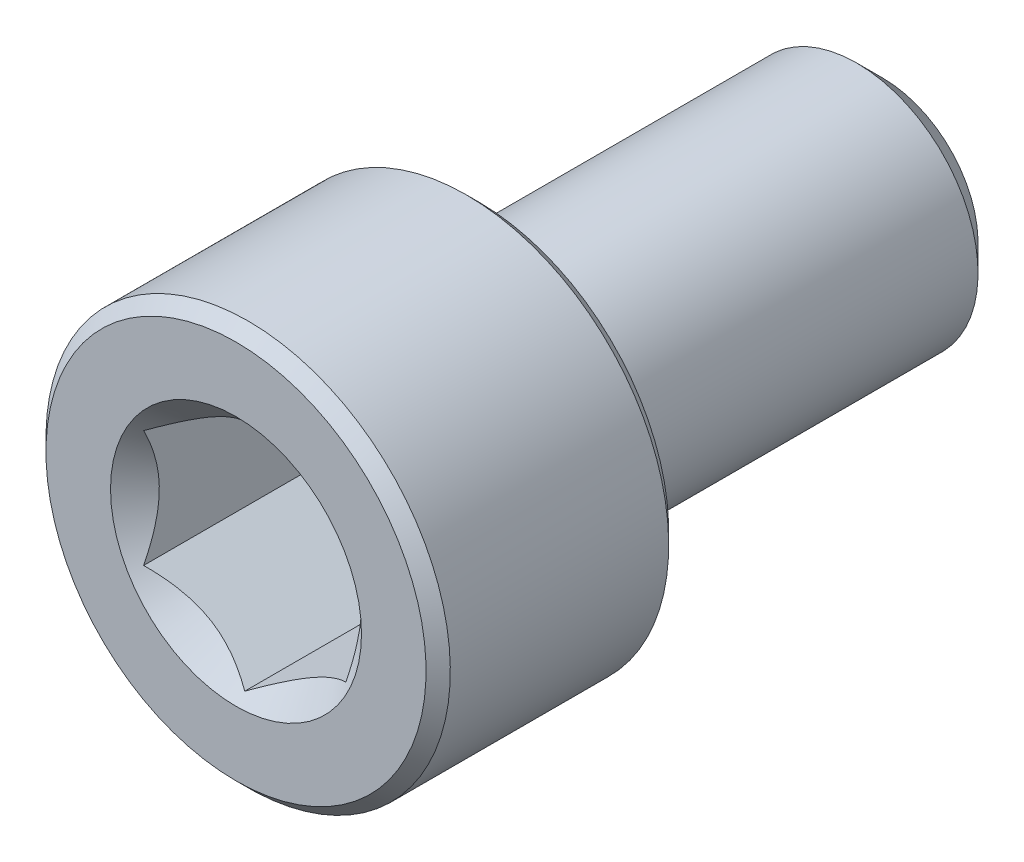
ISO-10303-21;
HEADER;
FILE_DESCRIPTION(('STEP AP214'),'2;1');
FILE_NAME('part.step','',(''),(''),'','','');
FILE_SCHEMA(('AUTOMOTIVE_DESIGN { 1 0 10303 214 1 1 1 1 }'));
ENDSEC;
DATA;
#1=APPLICATION_CONTEXT('core data for automotive mechanical design processes');
#2=APPLICATION_PROTOCOL_DEFINITION('international standard','automotive_design',2000,#1);
#3=PRODUCT_CONTEXT('',#1,'mechanical');
#4=PRODUCT('Part','Part','',(#3));
#5=PRODUCT_RELATED_PRODUCT_CATEGORY('part','',(#4));
#6=PRODUCT_DEFINITION_FORMATION('','',#4);
#7=PRODUCT_DEFINITION_CONTEXT('part definition',#1,'design');
#8=PRODUCT_DEFINITION('design','',#6,#7);
#9=PRODUCT_DEFINITION_SHAPE('','',#8);
#10=(LENGTH_UNIT() NAMED_UNIT(*) SI_UNIT(.MILLI.,.METRE.));
#11=(NAMED_UNIT(*) PLANE_ANGLE_UNIT() SI_UNIT($,.RADIAN.));
#12=(NAMED_UNIT(*) SI_UNIT($,.STERADIAN.) SOLID_ANGLE_UNIT());
#13=UNCERTAINTY_MEASURE_WITH_UNIT(LENGTH_MEASURE(1.E-05),#10,'distance_accuracy_value','');
#14=(GEOMETRIC_REPRESENTATION_CONTEXT(3) GLOBAL_UNCERTAINTY_ASSIGNED_CONTEXT((#13)) GLOBAL_UNIT_ASSIGNED_CONTEXT((#10,
#11,#12)) REPRESENTATION_CONTEXT('',''));
#15=CARTESIAN_POINT('',(0.,0.,0.));
#16=DIRECTION('',(0.,0.,1.));
#17=DIRECTION('',(1.,0.,0.));
#18=AXIS2_PLACEMENT_3D('',#15,#16,#17);
#19=CARTESIAN_POINT('',(0.,2.35048094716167,-8.));
#20=DIRECTION('',(0.,0.,-1.));
#21=DIRECTION('',(0.,1.,0.));
#22=AXIS2_PLACEMENT_3D('',#19,#20,#21);
#23=PLANE('',#22);
#24=CARTESIAN_POINT('',(0.,0.,-8.));
#25=DIRECTION('',(0.,0.,-1.));
#26=DIRECTION('',(0.,1.,0.));
#27=AXIS2_PLACEMENT_3D('',#24,#25,#26);
#28=CIRCLE('',#27,2.35048094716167);
#29=CARTESIAN_POINT('',(0.,2.35048094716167,-8.));
#30=VERTEX_POINT('',#29);
#31=EDGE_CURVE('E48',#30,#30,#28,.T.);
#32=ORIENTED_EDGE('',*,*,#31,.T.);
#33=EDGE_LOOP('',(#32));
#34=FACE_BOUND('',#33,.T.);
#35=ADVANCED_FACE('F35',(#34),#23,.T.);
#36=CARTESIAN_POINT('',(0.,0.,-8.));
#37=DIRECTION('',(0.,0.,1.));
#38=DIRECTION('',(0.,-1.,0.));
#39=AXIS2_PLACEMENT_3D('',#36,#37,#38);
#40=CONICAL_SURFACE('',#39,2.35048094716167,0.785398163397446);
#41=CARTESIAN_POINT('',(0.,0.,-7.35048094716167));
#42=DIRECTION('',(0.,0.,-1.));
#43=DIRECTION('',(0.,1.,0.));
#44=AXIS2_PLACEMENT_3D('',#41,#42,#43);
#45=CIRCLE('',#44,3.);
#46=CARTESIAN_POINT('',(0.,3.,-7.35048094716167));
#47=VERTEX_POINT('',#46);
#48=EDGE_CURVE('E151',#47,#47,#45,.T.);
#49=ORIENTED_EDGE('',*,*,#48,.T.);
#50=EDGE_LOOP('',(#49));
#51=FACE_BOUND('',#50,.T.);
#52=ORIENTED_EDGE('',*,*,#31,.F.);
#53=EDGE_LOOP('',(#52));
#54=FACE_BOUND('',#53,.T.);
#55=ADVANCED_FACE('F157',(#51,#54),#40,.T.);
#56=CARTESIAN_POINT('',(0.,0.,-8.));
#57=DIRECTION('',(0.,0.,-1.));
#58=DIRECTION('',(0.,1.,0.));
#59=AXIS2_PLACEMENT_3D('',#56,#57,#58);
#60=CYLINDRICAL_SURFACE('',#59,3.);
#61=CARTESIAN_POINT('',(0.,0.,1.7));
#62=DIRECTION('',(0.,0.,-1.));
#63=DIRECTION('',(0.,1.,0.));
#64=AXIS2_PLACEMENT_3D('',#61,#62,#63);
#65=CIRCLE('',#64,3.);
#66=CARTESIAN_POINT('',(0.,3.,1.7));
#67=VERTEX_POINT('',#66);
#68=EDGE_CURVE('E148',#67,#67,#65,.T.);
#69=ORIENTED_EDGE('',*,*,#68,.T.);
#70=EDGE_LOOP('',(#69));
#71=FACE_BOUND('',#70,.T.);
#72=ORIENTED_EDGE('',*,*,#48,.F.);
#73=EDGE_LOOP('',(#72));
#74=FACE_BOUND('',#73,.T.);
#75=ADVANCED_FACE('F159',(#71,#74),#60,.T.);
#76=CARTESIAN_POINT('',(0.,0.,1.7));
#77=DIRECTION('',(0.,0.,-1.));
#78=DIRECTION('',(0.,1.,0.));
#79=AXIS2_PLACEMENT_3D('',#76,#77,#78);
#80=TOROIDAL_SURFACE('',#79,3.3,0.299999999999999);
#81=CARTESIAN_POINT('',(0.,0.,2.));
#82=DIRECTION('',(0.,0.,-1.));
#83=DIRECTION('',(0.,1.,0.));
#84=AXIS2_PLACEMENT_3D('',#81,#82,#83);
#85=CIRCLE('',#84,3.3);
#86=CARTESIAN_POINT('',(0.,3.3,2.));
#87=VERTEX_POINT('',#86);
#88=EDGE_CURVE('E145',#87,#87,#85,.T.);
#89=ORIENTED_EDGE('',*,*,#88,.T.);
#90=EDGE_LOOP('',(#89));
#91=FACE_BOUND('',#90,.T.);
#92=ORIENTED_EDGE('',*,*,#68,.F.);
#93=EDGE_LOOP('',(#92));
#94=FACE_BOUND('',#93,.T.);
#95=ADVANCED_FACE('F165',(#91,#94),#80,.F.);
#96=CARTESIAN_POINT('',(0.,4.7,2.));
#97=DIRECTION('',(0.,0.,-1.));
#98=DIRECTION('',(0.,1.,0.));
#99=AXIS2_PLACEMENT_3D('',#96,#97,#98);
#100=PLANE('',#99);
#101=CARTESIAN_POINT('',(0.,0.,2.));
#102=DIRECTION('',(0.,0.,-1.));
#103=DIRECTION('',(0.,1.,0.));
#104=AXIS2_PLACEMENT_3D('',#101,#102,#103);
#105=CIRCLE('',#104,4.7);
#106=CARTESIAN_POINT('',(0.,4.7,2.));
#107=VERTEX_POINT('',#106);
#108=EDGE_CURVE('E142',#107,#107,#105,.T.);
#109=ORIENTED_EDGE('',*,*,#108,.T.);
#110=EDGE_LOOP('',(#109));
#111=FACE_BOUND('',#110,.T.);
#112=ORIENTED_EDGE('',*,*,#88,.F.);
#113=EDGE_LOOP('',(#112));
#114=FACE_BOUND('',#113,.T.);
#115=ADVANCED_FACE('F171',(#111,#114),#100,.T.);
#116=CARTESIAN_POINT('',(0.,0.,2.));
#117=DIRECTION('',(0.,0.,1.));
#118=DIRECTION('',(0.,-1.,0.));
#119=AXIS2_PLACEMENT_3D('',#116,#117,#118);
#120=CONICAL_SURFACE('',#119,4.7,0.785398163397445);
#121=CARTESIAN_POINT('',(0.,0.,2.3));
#122=DIRECTION('',(0.,0.,-1.));
#123=DIRECTION('',(0.,1.,0.));
#124=AXIS2_PLACEMENT_3D('',#121,#122,#123);
#125=CIRCLE('',#124,5.);
#126=CARTESIAN_POINT('',(0.,5.,2.3));
#127=VERTEX_POINT('',#126);
#128=EDGE_CURVE('E139',#127,#127,#125,.T.);
#129=ORIENTED_EDGE('',*,*,#128,.T.);
#130=EDGE_LOOP('',(#129));
#131=FACE_BOUND('',#130,.T.);
#132=ORIENTED_EDGE('',*,*,#108,.F.);
#133=EDGE_LOOP('',(#132));
#134=FACE_BOUND('',#133,.T.);
#135=ADVANCED_FACE('F175',(#131,#134),#120,.T.);
#136=CARTESIAN_POINT('',(0.,0.,-8.));
#137=DIRECTION('',(0.,0.,-1.));
#138=DIRECTION('',(0.,1.,0.));
#139=AXIS2_PLACEMENT_3D('',#136,#137,#138);
#140=CYLINDRICAL_SURFACE('',#139,5.);
#141=CARTESIAN_POINT('',(0.,0.,7.7));
#142=DIRECTION('',(0.,0.,-1.));
#143=DIRECTION('',(0.,1.,0.));
#144=AXIS2_PLACEMENT_3D('',#141,#142,#143);
#145=CIRCLE('',#144,5.);
#146=CARTESIAN_POINT('',(0.,5.,7.7));
#147=VERTEX_POINT('',#146);
#148=EDGE_CURVE('E136',#147,#147,#145,.T.);
#149=ORIENTED_EDGE('',*,*,#148,.T.);
#150=EDGE_LOOP('',(#149));
#151=FACE_BOUND('',#150,.T.);
#152=ORIENTED_EDGE('',*,*,#128,.F.);
#153=EDGE_LOOP('',(#152));
#154=FACE_BOUND('',#153,.T.);
#155=ADVANCED_FACE('F179',(#151,#154),#140,.T.);
#156=CARTESIAN_POINT('',(0.,0.,7.7));
#157=DIRECTION('',(0.,0.,-1.));
#158=DIRECTION('',(0.,1.,0.));
#159=AXIS2_PLACEMENT_3D('',#156,#157,#158);
#160=CONICAL_SURFACE('',#159,5.,0.785398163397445);
#161=CARTESIAN_POINT('',(0.,0.,8.));
#162=DIRECTION('',(0.,0.,-1.));
#163=DIRECTION('',(0.,1.,0.));
#164=AXIS2_PLACEMENT_3D('',#161,#162,#163);
#165=CIRCLE('',#164,4.7);
#166=CARTESIAN_POINT('',(0.,4.7,8.));
#167=VERTEX_POINT('',#166);
#168=EDGE_CURVE('E133',#167,#167,#165,.T.);
#169=ORIENTED_EDGE('',*,*,#168,.T.);
#170=EDGE_LOOP('',(#169));
#171=FACE_BOUND('',#170,.T.);
#172=ORIENTED_EDGE('',*,*,#148,.F.);
#173=EDGE_LOOP('',(#172));
#174=FACE_BOUND('',#173,.T.);
#175=ADVANCED_FACE('F183',(#171,#174),#160,.T.);
#176=CARTESIAN_POINT('',(0.,0.,8.));
#177=DIRECTION('',(0.,0.,1.));
#178=DIRECTION('',(0.,-1.,0.));
#179=AXIS2_PLACEMENT_3D('',#176,#177,#178);
#180=PLANE('',#179);
#181=CARTESIAN_POINT('',(0.,0.,8.));
#182=DIRECTION('',(0.,0.,1.));
#183=DIRECTION('',(1.,0.,0.));
#184=AXIS2_PLACEMENT_3D('',#181,#182,#183);
#185=CIRCLE('',#184,3.10325769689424);
#186=CARTESIAN_POINT('',(3.10325769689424,0.,8.));
#187=VERTEX_POINT('',#186);
#188=EDGE_CURVE('E107',#187,#187,#185,.T.);
#189=ORIENTED_EDGE('',*,*,#188,.F.);
#190=EDGE_LOOP('',(#189));
#191=FACE_BOUND('',#190,.T.);
#192=ORIENTED_EDGE('',*,*,#168,.F.);
#193=EDGE_LOOP('',(#192));
#194=FACE_BOUND('',#193,.T.);
#195=ADVANCED_FACE('F187',(#191,#194),#180,.T.);
#196=CARTESIAN_POINT('',(0.,0.,8.));
#197=DIRECTION('',(0.,0.,1.));
#198=DIRECTION('',(1.,0.,0.));
#199=AXIS2_PLACEMENT_3D('',#196,#197,#198);
#200=CONICAL_SURFACE('',#199,3.10325769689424,0.78539816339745);
#201=ORIENTED_EDGE('',*,*,#188,.T.);
#202=EDGE_LOOP('',(#201));
#203=FACE_BOUND('',#202,.T.);
#204=CARTESIAN_POINT('',(-0.000199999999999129,-2.88686681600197,7.78360912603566));
#205=CARTESIAN_POINT('',(0.0857382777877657,-2.83725032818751,7.73403435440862));
#206=CARTESIAN_POINT('',(0.173113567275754,-2.7868041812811,7.6873711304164));
#207=CARTESIAN_POINT('',(0.35128145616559,-2.6839389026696,7.60193178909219));
#208=CARTESIAN_POINT('',(0.442091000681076,-2.6315099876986,7.56320321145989));
#209=CARTESIAN_POINT('',(0.625204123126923,-2.52578957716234,7.49686035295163));
#210=CARTESIAN_POINT('',(0.717461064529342,-2.47252500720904,7.46907931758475));
#211=CARTESIAN_POINT('',(0.904006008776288,-2.3648232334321,7.42627682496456));
#212=CARTESIAN_POINT('',(0.998288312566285,-2.31038931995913,7.41122341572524));
#213=CARTESIAN_POINT('',(1.16077825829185,-2.21657570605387,7.39764137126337));
#214=CARTESIAN_POINT('',(1.22877596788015,-2.17731721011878,7.39563074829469));
#215=CARTESIAN_POINT('',(1.36466024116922,-2.0988643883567,7.39901776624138));
#216=CARTESIAN_POINT('',(1.43254675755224,-2.05967008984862,7.40441800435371));
#217=CARTESIAN_POINT('',(1.56767878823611,-1.98165157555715,7.42231943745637));
#218=CARTESIAN_POINT('',(1.63492349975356,-1.94282782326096,7.43482857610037));
#219=CARTESIAN_POINT('',(1.7682501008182,-1.86585167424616,7.4662611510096));
#220=CARTESIAN_POINT('',(1.83433207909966,-1.82769922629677,7.48518409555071));
#221=CARTESIAN_POINT('',(2.00359634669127,-1.72997445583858,7.54136101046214));
#222=CARTESIAN_POINT('',(2.10572912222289,-1.67100807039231,7.58284948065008));
#223=CARTESIAN_POINT('',(2.25590641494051,-1.58430317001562,7.65288769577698));
#224=CARTESIAN_POINT('',(2.30539653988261,-1.55573003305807,7.67749590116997));
#225=CARTESIAN_POINT('',(2.40346006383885,-1.49911303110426,7.72895553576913));
#226=CARTESIAN_POINT('',(2.45203400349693,-1.47106885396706,7.75580558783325));
#227=CARTESIAN_POINT('',(2.5002,-1.44326020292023,7.78360912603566));
#228=B_SPLINE_CURVE_WITH_KNOTS('',3,(#204,#205,#206,#207,#208,#209,#210,#211,#212,#213,#214,
#215,#216,#217,#218,#219,#220,#221,#222,#223,#224,#225,#226,#227),.UNSPECIFIED.,.F.,.F.,(4,2,2,
2,2,2,2,2,2,2,2,4),(0.,0.333012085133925,0.667964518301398,0.997597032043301,1.32639954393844,
1.56169424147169,1.79707142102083,2.03271213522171,2.26833478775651,2.64260240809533,
2.82922877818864,3.01574133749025),.UNSPECIFIED.);
#229=CARTESIAN_POINT('',(0.,-2.88675134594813,7.78349364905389));
#230=VERTEX_POINT('',#229);
#231=CARTESIAN_POINT('',(2.5,-1.44337567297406,7.78349364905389));
#232=VERTEX_POINT('',#231);
#233=EDGE_CURVE('E12',#230,#232,#228,.T.);
#234=ORIENTED_EDGE('',*,*,#233,.F.);
#235=CARTESIAN_POINT('',(-2.5002,-1.44326020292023,7.78360912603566));
#236=CARTESIAN_POINT('',(-2.41426172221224,-1.49287669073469,7.73403435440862));
#237=CARTESIAN_POINT('',(-2.32688643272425,-1.5433228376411,7.6873711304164));
#238=CARTESIAN_POINT('',(-2.14871854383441,-1.64618811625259,7.60193178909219));
#239=CARTESIAN_POINT('',(-2.05790899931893,-1.69861703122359,7.56320321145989));
#240=CARTESIAN_POINT('',(-1.87479587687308,-1.80433744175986,7.49686035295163));
#241=CARTESIAN_POINT('',(-1.78253893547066,-1.85760201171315,7.46907931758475));
#242=CARTESIAN_POINT('',(-1.59599399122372,-1.96530378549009,7.42627682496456));
#243=CARTESIAN_POINT('',(-1.50171168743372,-2.01973769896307,7.41122341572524));
#244=CARTESIAN_POINT('',(-1.33922174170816,-2.11355131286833,7.39764137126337));
#245=CARTESIAN_POINT('',(-1.27122403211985,-2.15280980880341,7.39563074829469));
#246=CARTESIAN_POINT('',(-1.13533975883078,-2.23126263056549,7.39901776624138));
#247=CARTESIAN_POINT('',(-1.06745324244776,-2.27045692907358,7.40441800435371));
#248=CARTESIAN_POINT('',(-0.932321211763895,-2.34847544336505,7.42231943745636));
#249=CARTESIAN_POINT('',(-0.865076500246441,-2.38729919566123,7.43482857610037));
#250=CARTESIAN_POINT('',(-0.731749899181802,-2.46427534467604,7.4662611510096));
#251=CARTESIAN_POINT('',(-0.665667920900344,-2.50242779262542,7.48518409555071));
#252=CARTESIAN_POINT('',(-0.496403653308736,-2.60015256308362,7.54136101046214));
#253=CARTESIAN_POINT('',(-0.394270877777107,-2.65911894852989,7.58284948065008));
#254=CARTESIAN_POINT('',(-0.244093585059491,-2.74582384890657,7.65288769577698));
#255=CARTESIAN_POINT('',(-0.19460346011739,-2.77439698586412,7.67749590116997));
#256=CARTESIAN_POINT('',(-0.0965399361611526,-2.83101398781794,7.72895553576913));
#257=CARTESIAN_POINT('',(-0.0479659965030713,-2.85905816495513,7.75580558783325));
#258=CARTESIAN_POINT('',(0.000200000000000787,-2.88686681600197,7.78360912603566));
#259=B_SPLINE_CURVE_WITH_KNOTS('',3,(#235,#236,#237,#238,#239,#240,#241,#242,#243,#244,#245,
#246,#247,#248,#249,#250,#251,#252,#253,#254,#255,#256,#257,#258),.UNSPECIFIED.,.F.,.F.,(4,2,2,
2,2,2,2,2,2,2,2,4),(0.,0.333012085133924,0.667964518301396,0.997597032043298,1.32639954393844,
1.56169424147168,1.79707142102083,2.03271213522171,2.26833478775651,2.64260240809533,
2.82922877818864,3.01574133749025),.UNSPECIFIED.);
#260=CARTESIAN_POINT('',(-2.5,-1.44337567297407,7.78349364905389));
#261=VERTEX_POINT('',#260);
#262=EDGE_CURVE('E93',#261,#230,#259,.T.);
#263=ORIENTED_EDGE('',*,*,#262,.F.);
#264=CARTESIAN_POINT('',(-2.5,-3.0404429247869,8.83302140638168));
#265=CARTESIAN_POINT('',(-2.5,-2.96709478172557,8.77637884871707));
#266=CARTESIAN_POINT('',(-2.5,-2.89335465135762,8.7202359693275));
#267=CARTESIAN_POINT('',(-2.5,-2.74492905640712,8.60917878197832));
#268=CARTESIAN_POINT('',(-2.5,-2.67024337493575,8.55426476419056));
#269=CARTESIAN_POINT('',(-2.5,-2.51921990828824,8.44550384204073));
#270=CARTESIAN_POINT('',(-2.5,-2.44287382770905,8.39166841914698));
#271=CARTESIAN_POINT('',(-2.5,-2.28891665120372,8.28584416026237));
#272=CARTESIAN_POINT('',(-2.5,-2.21130564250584,8.23385519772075));
#273=CARTESIAN_POINT('',(-2.5,-2.04951799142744,8.12884570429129));
#274=CARTESIAN_POINT('',(-2.5,-1.96524215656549,8.07597723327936));
#275=CARTESIAN_POINT('',(-2.5,-1.79473490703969,7.97349870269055));
#276=CARTESIAN_POINT('',(-2.5,-1.70850374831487,7.92388821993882));
#277=CARTESIAN_POINT('',(-2.5,-1.53401833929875,7.82895452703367));
#278=CARTESIAN_POINT('',(-2.5,-1.44577065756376,7.78361933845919));
#279=CARTESIAN_POINT('',(-2.5,-1.26676310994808,7.69826042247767));
#280=CARTESIAN_POINT('',(-2.5,-1.17600446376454,7.65823416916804));
#281=CARTESIAN_POINT('',(-2.5,-1.00118351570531,7.58869628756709));
#282=CARTESIAN_POINT('',(-2.5,-0.917385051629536,7.55852808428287));
#283=CARTESIAN_POINT('',(-2.5,-0.747629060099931,7.50489693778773));
#284=CARTESIAN_POINT('',(-2.5,-0.661671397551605,7.48143441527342));
#285=CARTESIAN_POINT('',(-2.5,-0.489622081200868,7.44288576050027));
#286=CARTESIAN_POINT('',(-2.5,-0.40356552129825,7.42764564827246));
#287=CARTESIAN_POINT('',(-2.5,-0.230352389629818,7.40586394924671));
#288=CARTESIAN_POINT('',(-2.5,-0.143196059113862,7.39932048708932));
#289=CARTESIAN_POINT('',(-2.5,0.0273612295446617,7.39550416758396));
#290=CARTESIAN_POINT('',(-2.5,0.110753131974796,7.39782410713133));
#291=CARTESIAN_POINT('',(-2.5,0.276898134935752,7.41066533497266));
#292=CARTESIAN_POINT('',(-2.5,0.359651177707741,7.42118735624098));
#293=CARTESIAN_POINT('',(-2.5,0.525325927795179,7.45001149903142));
#294=CARTESIAN_POINT('',(-2.5,0.608223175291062,7.46845204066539));
#295=CARTESIAN_POINT('',(-2.5,0.772178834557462,7.51208468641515));
#296=CARTESIAN_POINT('',(-2.5,0.853237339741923,7.53727644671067));
#297=CARTESIAN_POINT('',(-2.5,1.10159689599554,7.62411939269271));
#298=CARTESIAN_POINT('',(-2.5,1.2655525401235,7.69536683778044));
#299=CARTESIAN_POINT('',(-2.5,1.50551769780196,7.81423454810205));
#300=CARTESIAN_POINT('',(-2.5,1.58465788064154,7.85594845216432));
#301=CARTESIAN_POINT('',(-2.5,1.74114816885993,7.94261616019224));
#302=CARTESIAN_POINT('',(-2.5,1.81849858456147,7.9875693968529));
#303=CARTESIAN_POINT('',(-2.5,1.96784059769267,8.07778535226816));
#304=CARTESIAN_POINT('',(-2.5,2.03990833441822,8.12292344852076));
#305=CARTESIAN_POINT('',(-2.5,2.18280709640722,8.21512574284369));
#306=CARTESIAN_POINT('',(-2.5,2.2536380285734,8.26219008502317));
#307=CARTESIAN_POINT('',(-2.5,2.39365462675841,8.35751814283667));
#308=CARTESIAN_POINT('',(-2.5,2.46284892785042,8.40576922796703));
#309=CARTESIAN_POINT('',(-2.5,2.60028772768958,8.50356759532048));
#310=CARTESIAN_POINT('',(-2.5,2.66853248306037,8.5531145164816));
#311=CARTESIAN_POINT('',(-2.5,2.73637900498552,8.6031920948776));
#312=B_SPLINE_CURVE_WITH_KNOTS('',3,(#264,#265,#266,#267,#268,#269,#270,#271,#272,#273,#274,
#275,#276,#277,#278,#279,#280,#281,#282,#283,#284,#285,#286,#287,#288,#289,#290,#291,#292,#293,
#294,#295,#296,#297,#298,#299,#300,#301,#302,#303,#304,#305,#306,#307,#308,#309,#310,#311),
.UNSPECIFIED.,.F.,.F.,(4,2,2,2,2,2,2,2,2,2,2,2,2,2,2,2,2,2,2,2,2,2,2,4),(0.,0.278024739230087,
0.556114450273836,0.836346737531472,1.11655978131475,1.41496015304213,1.71332168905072,
2.01082076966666,2.30817779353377,2.57513879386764,2.84211653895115,3.10390388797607,
3.36563477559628,3.61548897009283,3.86536549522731,4.11980016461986,4.37422187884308,
4.90887010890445,5.17722912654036,5.44554126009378,5.70061957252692,5.95571700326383,
6.20877059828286,6.46175442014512),.UNSPECIFIED.);
#313=CARTESIAN_POINT('',(-2.5,1.44337567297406,7.78349364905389));
#314=VERTEX_POINT('',#313);
#315=EDGE_CURVE('E106',#314,#261,#312,.F.);
#316=ORIENTED_EDGE('',*,*,#315,.F.);
#317=CARTESIAN_POINT('',(0.000199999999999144,2.88686681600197,7.78360912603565));
#318=CARTESIAN_POINT('',(-0.0857382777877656,2.83725032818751,7.73403435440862));
#319=CARTESIAN_POINT('',(-0.173113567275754,2.7868041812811,7.6873711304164));
#320=CARTESIAN_POINT('',(-0.351281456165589,2.6839389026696,7.60193178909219));
#321=CARTESIAN_POINT('',(-0.442091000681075,2.6315099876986,7.56320321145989));
#322=CARTESIAN_POINT('',(-0.625204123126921,2.52578957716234,7.49686035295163));
#323=CARTESIAN_POINT('',(-0.717461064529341,2.47252500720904,7.46907931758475));
#324=CARTESIAN_POINT('',(-0.904006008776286,2.3648232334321,7.42627682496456));
#325=CARTESIAN_POINT('',(-0.998288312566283,2.31038931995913,7.41122341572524));
#326=CARTESIAN_POINT('',(-1.16077825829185,2.21657570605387,7.39764137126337));
#327=CARTESIAN_POINT('',(-1.22877596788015,2.17731721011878,7.39563074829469));
#328=CARTESIAN_POINT('',(-1.36466024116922,2.0988643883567,7.39901776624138));
#329=CARTESIAN_POINT('',(-1.43254675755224,2.05967008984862,7.40441800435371));
#330=CARTESIAN_POINT('',(-1.56767878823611,1.98165157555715,7.42231943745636));
#331=CARTESIAN_POINT('',(-1.63492349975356,1.94282782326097,7.43482857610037));
#332=CARTESIAN_POINT('',(-1.7682501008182,1.86585167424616,7.4662611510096));
#333=CARTESIAN_POINT('',(-1.83433207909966,1.82769922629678,7.48518409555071));
#334=CARTESIAN_POINT('',(-2.00359634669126,1.72997445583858,7.54136101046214));
#335=CARTESIAN_POINT('',(-2.10572912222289,1.67100807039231,7.58284948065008));
#336=CARTESIAN_POINT('',(-2.25590641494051,1.58430317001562,7.65288769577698));
#337=CARTESIAN_POINT('',(-2.30539653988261,1.55573003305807,7.67749590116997));
#338=CARTESIAN_POINT('',(-2.40346006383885,1.49911303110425,7.72895553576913));
#339=CARTESIAN_POINT('',(-2.45203400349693,1.47106885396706,7.75580558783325));
#340=CARTESIAN_POINT('',(-2.5002,1.44326020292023,7.78360912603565));
#341=B_SPLINE_CURVE_WITH_KNOTS('',3,(#317,#318,#319,#320,#321,#322,#323,#324,#325,#326,#327,
#328,#329,#330,#331,#332,#333,#334,#335,#336,#337,#338,#339,#340),.UNSPECIFIED.,.F.,.F.,(4,2,2,
2,2,2,2,2,2,2,2,4),(0.,0.333012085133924,0.667964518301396,0.997597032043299,1.32639954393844,
1.56169424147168,1.79707142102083,2.03271213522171,2.2683347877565,2.64260240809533,
2.82922877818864,3.01574133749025),.UNSPECIFIED.);
#342=CARTESIAN_POINT('',(0.,2.88675134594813,7.78349364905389));
#343=VERTEX_POINT('',#342);
#344=EDGE_CURVE('E237',#343,#314,#341,.T.);
#345=ORIENTED_EDGE('',*,*,#344,.F.);
#346=CARTESIAN_POINT('',(2.5002,1.44326020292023,7.78360912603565));
#347=CARTESIAN_POINT('',(2.41426172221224,1.49287669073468,7.73403435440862));
#348=CARTESIAN_POINT('',(2.32688643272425,1.5433228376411,7.6873711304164));
#349=CARTESIAN_POINT('',(2.14871854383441,1.64618811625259,7.60193178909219));
#350=CARTESIAN_POINT('',(2.05790899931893,1.69861703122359,7.56320321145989));
#351=CARTESIAN_POINT('',(1.87479587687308,1.80433744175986,7.49686035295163));
#352=CARTESIAN_POINT('',(1.78253893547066,1.85760201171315,7.46907931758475));
#353=CARTESIAN_POINT('',(1.59599399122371,1.96530378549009,7.42627682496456));
#354=CARTESIAN_POINT('',(1.50171168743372,2.01973769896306,7.41122341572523));
#355=CARTESIAN_POINT('',(1.33922174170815,2.11355131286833,7.39764137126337));
#356=CARTESIAN_POINT('',(1.27122403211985,2.15280980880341,7.39563074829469));
#357=CARTESIAN_POINT('',(1.13533975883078,2.23126263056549,7.39901776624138));
#358=CARTESIAN_POINT('',(1.06745324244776,2.27045692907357,7.40441800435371));
#359=CARTESIAN_POINT('',(0.932321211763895,2.34847544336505,7.42231943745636));
#360=CARTESIAN_POINT('',(0.86507650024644,2.38729919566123,7.43482857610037));
#361=CARTESIAN_POINT('',(0.731749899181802,2.46427534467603,7.4662611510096));
#362=CARTESIAN_POINT('',(0.665667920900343,2.50242779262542,7.48518409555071));
#363=CARTESIAN_POINT('',(0.496403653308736,2.60015256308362,7.54136101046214));
#364=CARTESIAN_POINT('',(0.394270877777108,2.65911894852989,7.58284948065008));
#365=CARTESIAN_POINT('',(0.244093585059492,2.74582384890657,7.65288769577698));
#366=CARTESIAN_POINT('',(0.194603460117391,2.77439698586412,7.67749590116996));
#367=CARTESIAN_POINT('',(0.0965399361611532,2.83101398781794,7.72895553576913));
#368=CARTESIAN_POINT('',(0.0479659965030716,2.85905816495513,7.75580558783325));
#369=CARTESIAN_POINT('',(-0.000200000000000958,2.88686681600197,7.78360912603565));
#370=B_SPLINE_CURVE_WITH_KNOTS('',3,(#346,#347,#348,#349,#350,#351,#352,#353,#354,#355,#356,
#357,#358,#359,#360,#361,#362,#363,#364,#365,#366,#367,#368,#369),.UNSPECIFIED.,.F.,.F.,(4,2,2,
2,2,2,2,2,2,2,2,4),(0.,0.333012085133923,0.667964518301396,0.997597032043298,1.32639954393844,
1.56169424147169,1.79707142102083,2.03271213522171,2.2683347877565,2.64260240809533,
2.82922877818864,3.01574133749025),.UNSPECIFIED.);
#371=CARTESIAN_POINT('',(2.5,1.44337567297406,7.78349364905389));
#372=VERTEX_POINT('',#371);
#373=EDGE_CURVE('E210',#372,#343,#370,.T.);
#374=ORIENTED_EDGE('',*,*,#373,.F.);
#375=CARTESIAN_POINT('',(2.5,-3.0404429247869,8.83302140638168));
#376=CARTESIAN_POINT('',(2.5,-2.96709478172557,8.77637884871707));
#377=CARTESIAN_POINT('',(2.5,-2.89335465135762,8.7202359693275));
#378=CARTESIAN_POINT('',(2.5,-2.74492905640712,8.60917878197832));
#379=CARTESIAN_POINT('',(2.5,-2.67024337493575,8.55426476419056));
#380=CARTESIAN_POINT('',(2.5,-2.51921990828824,8.44550384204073));
#381=CARTESIAN_POINT('',(2.5,-2.44287382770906,8.39166841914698));
#382=CARTESIAN_POINT('',(2.5,-2.28891665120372,8.28584416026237));
#383=CARTESIAN_POINT('',(2.5,-2.21130564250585,8.23385519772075));
#384=CARTESIAN_POINT('',(2.5,-2.04951799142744,8.12884570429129));
#385=CARTESIAN_POINT('',(2.5,-1.96524215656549,8.07597723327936));
#386=CARTESIAN_POINT('',(2.5,-1.79473490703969,7.97349870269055));
#387=CARTESIAN_POINT('',(2.5,-1.70850374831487,7.92388821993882));
#388=CARTESIAN_POINT('',(2.5,-1.53401833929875,7.82895452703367));
#389=CARTESIAN_POINT('',(2.5,-1.44577065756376,7.78361933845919));
#390=CARTESIAN_POINT('',(2.5,-1.26676310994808,7.69826042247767));
#391=CARTESIAN_POINT('',(2.5,-1.17600446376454,7.65823416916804));
#392=CARTESIAN_POINT('',(2.5,-1.00118351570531,7.58869628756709));
#393=CARTESIAN_POINT('',(2.5,-0.917385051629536,7.55852808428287));
#394=CARTESIAN_POINT('',(2.5,-0.747629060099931,7.50489693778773));
#395=CARTESIAN_POINT('',(2.5,-0.661671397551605,7.48143441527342));
#396=CARTESIAN_POINT('',(2.5,-0.489622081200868,7.44288576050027));
#397=CARTESIAN_POINT('',(2.5,-0.40356552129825,7.42764564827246));
#398=CARTESIAN_POINT('',(2.5,-0.230352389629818,7.40586394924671));
#399=CARTESIAN_POINT('',(2.5,-0.143196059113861,7.39932048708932));
#400=CARTESIAN_POINT('',(2.5,0.0273612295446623,7.39550416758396));
#401=CARTESIAN_POINT('',(2.5,0.110753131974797,7.39782410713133));
#402=CARTESIAN_POINT('',(2.5,0.276898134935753,7.41066533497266));
#403=CARTESIAN_POINT('',(2.5,0.359651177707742,7.42118735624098));
#404=CARTESIAN_POINT('',(2.5,0.52532592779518,7.45001149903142));
#405=CARTESIAN_POINT('',(2.5,0.608223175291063,7.46845204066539));
#406=CARTESIAN_POINT('',(2.5,0.772178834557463,7.51208468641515));
#407=CARTESIAN_POINT('',(2.5,0.853237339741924,7.53727644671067));
#408=CARTESIAN_POINT('',(2.5,1.10159689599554,7.62411939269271));
#409=CARTESIAN_POINT('',(2.5,1.2655525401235,7.69536683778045));
#410=CARTESIAN_POINT('',(2.5,1.50551769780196,7.81423454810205));
#411=CARTESIAN_POINT('',(2.5,1.58465788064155,7.85594845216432));
#412=CARTESIAN_POINT('',(2.5,1.74114816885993,7.94261616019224));
#413=CARTESIAN_POINT('',(2.5,1.81849858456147,7.9875693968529));
#414=CARTESIAN_POINT('',(2.5,1.96784059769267,8.07778535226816));
#415=CARTESIAN_POINT('',(2.5,2.03990833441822,8.12292344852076));
#416=CARTESIAN_POINT('',(2.5,2.18280709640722,8.21512574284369));
#417=CARTESIAN_POINT('',(2.5,2.2536380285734,8.26219008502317));
#418=CARTESIAN_POINT('',(2.5,2.39365462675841,8.35751814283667));
#419=CARTESIAN_POINT('',(2.5,2.46284892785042,8.40576922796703));
#420=CARTESIAN_POINT('',(2.5,2.60028772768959,8.50356759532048));
#421=CARTESIAN_POINT('',(2.5,2.66853248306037,8.5531145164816));
#422=CARTESIAN_POINT('',(2.5,2.73637900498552,8.6031920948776));
#423=B_SPLINE_CURVE_WITH_KNOTS('',3,(#375,#376,#377,#378,#379,#380,#381,#382,#383,#384,#385,
#386,#387,#388,#389,#390,#391,#392,#393,#394,#395,#396,#397,#398,#399,#400,#401,#402,#403,#404,
#405,#406,#407,#408,#409,#410,#411,#412,#413,#414,#415,#416,#417,#418,#419,#420,#421,#422),
.UNSPECIFIED.,.F.,.F.,(4,2,2,2,2,2,2,2,2,2,2,2,2,2,2,2,2,2,2,2,2,2,2,4),(0.,0.278024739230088,
0.556114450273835,0.836346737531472,1.11655978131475,1.41496015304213,1.71332168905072,
2.01082076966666,2.30817779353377,2.57513879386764,2.84211653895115,3.10390388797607,
3.36563477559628,3.61548897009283,3.86536549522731,4.11980016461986,4.37422187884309,
4.90887010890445,5.17722912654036,5.44554126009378,5.70061957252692,5.95571700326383,
6.20877059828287,6.46175442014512),.UNSPECIFIED.);
#424=EDGE_CURVE('E55',#232,#372,#423,.T.);
#425=ORIENTED_EDGE('',*,*,#424,.F.);
#426=EDGE_LOOP('',(#234,#263,#316,#345,#374,#425));
#427=FACE_BOUND('',#426,.T.);
#428=ADVANCED_FACE('F92',(#203,#427),#200,.F.);
#429=CARTESIAN_POINT('',(0.,4.7,3.));
#430=DIRECTION('',(0.,0.,-1.));
#431=DIRECTION('',(0.,1.,0.));
#432=AXIS2_PLACEMENT_3D('',#429,#430,#431);
#433=PLANE('',#432);
#434=DIRECTION('',(0.866025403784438,0.5,0.));
#435=VECTOR('',#434,1.);
#436=CARTESIAN_POINT('',(0.,-2.88675134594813,3.));
#437=LINE('',#436,#435);
#438=CARTESIAN_POINT('',(0.,-2.88675134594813,3.));
#439=VERTEX_POINT('',#438);
#440=CARTESIAN_POINT('',(2.5,-1.44337567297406,3.));
#441=VERTEX_POINT('',#440);
#442=EDGE_CURVE('E110',#439,#441,#437,.T.);
#443=ORIENTED_EDGE('',*,*,#442,.T.);
#444=DIRECTION('',(0.,1.,0.));
#445=VECTOR('',#444,1.);
#446=CARTESIAN_POINT('',(2.5,-1.44337567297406,3.));
#447=LINE('',#446,#445);
#448=CARTESIAN_POINT('',(2.5,1.44337567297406,3.));
#449=VERTEX_POINT('',#448);
#450=EDGE_CURVE('E62',#441,#449,#447,.T.);
#451=ORIENTED_EDGE('',*,*,#450,.T.);
#452=DIRECTION('',(-0.866025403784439,0.5,0.));
#453=VECTOR('',#452,1.);
#454=CARTESIAN_POINT('',(2.5,1.44337567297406,3.));
#455=LINE('',#454,#453);
#456=CARTESIAN_POINT('',(0.,2.88675134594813,3.));
#457=VERTEX_POINT('',#456);
#458=EDGE_CURVE('E118',#449,#457,#455,.T.);
#459=ORIENTED_EDGE('',*,*,#458,.T.);
#460=DIRECTION('',(-0.866025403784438,-0.5,0.));
#461=VECTOR('',#460,1.);
#462=CARTESIAN_POINT('',(0.,2.88675134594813,3.));
#463=LINE('',#462,#461);
#464=CARTESIAN_POINT('',(-2.5,1.44337567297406,3.));
#465=VERTEX_POINT('',#464);
#466=EDGE_CURVE('E125',#457,#465,#463,.T.);
#467=ORIENTED_EDGE('',*,*,#466,.T.);
#468=DIRECTION('',(0.,-1.,0.));
#469=VECTOR('',#468,1.);
#470=CARTESIAN_POINT('',(-2.5,1.44337567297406,3.));
#471=LINE('',#470,#469);
#472=CARTESIAN_POINT('',(-2.5,-1.44337567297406,3.));
#473=VERTEX_POINT('',#472);
#474=EDGE_CURVE('E121',#465,#473,#471,.T.);
#475=ORIENTED_EDGE('',*,*,#474,.T.);
#476=DIRECTION('',(0.866025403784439,-0.5,0.));
#477=VECTOR('',#476,1.);
#478=CARTESIAN_POINT('',(-2.5,-1.44337567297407,3.));
#479=LINE('',#478,#477);
#480=EDGE_CURVE('E111',#473,#439,#479,.T.);
#481=ORIENTED_EDGE('',*,*,#480,.T.);
#482=EDGE_LOOP('',(#443,#451,#459,#467,#475,#481));
#483=FACE_BOUND('',#482,.T.);
#484=ADVANCED_FACE('F192',(#483),#433,.F.);
#485=CARTESIAN_POINT('',(0.,-2.88675134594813,-5.63762615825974));
#486=DIRECTION('',(0.5,-0.866025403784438,0.));
#487=DIRECTION('',(0.866025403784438,0.5,0.));
#488=AXIS2_PLACEMENT_3D('',#485,#486,#487);
#489=PLANE('',#488);
#490=DIRECTION('',(0.,0.,1.));
#491=VECTOR('',#490,1.);
#492=CARTESIAN_POINT('',(0.,-2.88675134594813,-5.63762615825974));
#493=LINE('',#492,#491);
#494=EDGE_CURVE('E102',#439,#230,#493,.T.);
#495=ORIENTED_EDGE('',*,*,#494,.T.);
#496=ORIENTED_EDGE('',*,*,#233,.T.);
#497=DIRECTION('',(0.,0.,1.));
#498=VECTOR('',#497,1.);
#499=CARTESIAN_POINT('',(2.5,-1.44337567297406,-5.63762615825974));
#500=LINE('',#499,#498);
#501=EDGE_CURVE('E113',#441,#232,#500,.T.);
#502=ORIENTED_EDGE('',*,*,#501,.F.);
#503=ORIENTED_EDGE('',*,*,#442,.F.);
#504=EDGE_LOOP('',(#495,#496,#502,#503));
#505=FACE_BOUND('',#504,.T.);
#506=ADVANCED_FACE('F109',(#505),#489,.F.);
#507=CARTESIAN_POINT('',(-2.5,-1.44337567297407,-5.63762615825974));
#508=DIRECTION('',(-0.5,-0.866025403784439,0.));
#509=DIRECTION('',(0.866025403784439,-0.5,0.));
#510=AXIS2_PLACEMENT_3D('',#507,#508,#509);
#511=PLANE('',#510);
#512=DIRECTION('',(0.,0.,1.));
#513=VECTOR('',#512,1.);
#514=CARTESIAN_POINT('',(-2.5,-1.44337567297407,-5.63762615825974));
#515=LINE('',#514,#513);
#516=EDGE_CURVE('E105',#473,#261,#515,.T.);
#517=ORIENTED_EDGE('',*,*,#516,.T.);
#518=ORIENTED_EDGE('',*,*,#262,.T.);
#519=ORIENTED_EDGE('',*,*,#494,.F.);
#520=ORIENTED_EDGE('',*,*,#480,.F.);
#521=EDGE_LOOP('',(#517,#518,#519,#520));
#522=FACE_BOUND('',#521,.T.);
#523=ADVANCED_FACE('F101',(#522),#511,.F.);
#524=CARTESIAN_POINT('',(-2.5,1.44337567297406,-5.63762615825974));
#525=DIRECTION('',(-1.,0.,0.));
#526=DIRECTION('',(0.,0.,1.));
#527=AXIS2_PLACEMENT_3D('',#524,#525,#526);
#528=PLANE('',#527);
#529=DIRECTION('',(0.,0.,1.));
#530=VECTOR('',#529,1.);
#531=CARTESIAN_POINT('',(-2.5,1.44337567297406,-5.63762615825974));
#532=LINE('',#531,#530);
#533=EDGE_CURVE('E122',#465,#314,#532,.T.);
#534=ORIENTED_EDGE('',*,*,#533,.T.);
#535=ORIENTED_EDGE('',*,*,#315,.T.);
#536=ORIENTED_EDGE('',*,*,#516,.F.);
#537=ORIENTED_EDGE('',*,*,#474,.F.);
#538=EDGE_LOOP('',(#534,#535,#536,#537));
#539=FACE_BOUND('',#538,.T.);
#540=ADVANCED_FACE('F246',(#539),#528,.F.);
#541=CARTESIAN_POINT('',(0.,2.88675134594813,-5.63762615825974));
#542=DIRECTION('',(-0.5,0.866025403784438,0.));
#543=DIRECTION('',(-0.866025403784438,-0.5,0.));
#544=AXIS2_PLACEMENT_3D('',#541,#542,#543);
#545=PLANE('',#544);
#546=DIRECTION('',(0.,0.,1.));
#547=VECTOR('',#546,1.);
#548=CARTESIAN_POINT('',(0.,2.88675134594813,-5.63762615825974));
#549=LINE('',#548,#547);
#550=EDGE_CURVE('E126',#457,#343,#549,.T.);
#551=ORIENTED_EDGE('',*,*,#550,.T.);
#552=ORIENTED_EDGE('',*,*,#344,.T.);
#553=ORIENTED_EDGE('',*,*,#533,.F.);
#554=ORIENTED_EDGE('',*,*,#466,.F.);
#555=EDGE_LOOP('',(#551,#552,#553,#554));
#556=FACE_BOUND('',#555,.T.);
#557=ADVANCED_FACE('F243',(#556),#545,.F.);
#558=CARTESIAN_POINT('',(2.5,1.44337567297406,-5.63762615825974));
#559=DIRECTION('',(0.5,0.866025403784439,0.));
#560=DIRECTION('',(-0.866025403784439,0.5,0.));
#561=AXIS2_PLACEMENT_3D('',#558,#559,#560);
#562=PLANE('',#561);
#563=DIRECTION('',(0.,0.,1.));
#564=VECTOR('',#563,1.);
#565=CARTESIAN_POINT('',(2.5,1.44337567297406,-5.63762615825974));
#566=LINE('',#565,#564);
#567=EDGE_CURVE('E129',#449,#372,#566,.T.);
#568=ORIENTED_EDGE('',*,*,#567,.T.);
#569=ORIENTED_EDGE('',*,*,#373,.T.);
#570=ORIENTED_EDGE('',*,*,#550,.F.);
#571=ORIENTED_EDGE('',*,*,#458,.F.);
#572=EDGE_LOOP('',(#568,#569,#570,#571));
#573=FACE_BOUND('',#572,.T.);
#574=ADVANCED_FACE('F200',(#573),#562,.F.);
#575=CARTESIAN_POINT('',(2.5,-1.44337567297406,-5.63762615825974));
#576=DIRECTION('',(1.,0.,0.));
#577=DIRECTION('',(0.,0.,-1.));
#578=AXIS2_PLACEMENT_3D('',#575,#576,#577);
#579=PLANE('',#578);
#580=ORIENTED_EDGE('',*,*,#501,.T.);
#581=ORIENTED_EDGE('',*,*,#424,.T.);
#582=ORIENTED_EDGE('',*,*,#567,.F.);
#583=ORIENTED_EDGE('',*,*,#450,.F.);
#584=EDGE_LOOP('',(#580,#581,#582,#583));
#585=FACE_BOUND('',#584,.T.);
#586=ADVANCED_FACE('F196',(#585),#579,.F.);
#587=CLOSED_SHELL('',(#35,#55,#75,#95,#115,#135,#155,#175,#195,#428,#484,#506,#523,#540,#557,
#574,#586));
#588=MANIFOLD_SOLID_BREP('B2',#587);
#589=ADVANCED_BREP_SHAPE_REPRESENTATION('',(#18,#588),#14);
#590=SHAPE_DEFINITION_REPRESENTATION(#9,#589);
ENDSEC;
END-ISO-10303-21;
